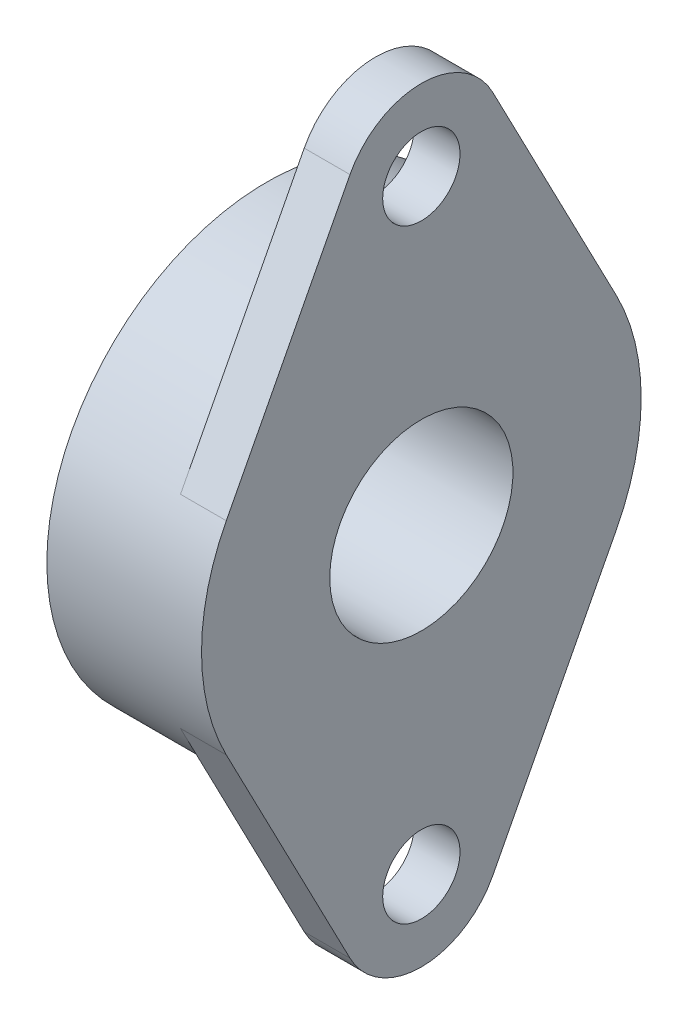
ISO-10303-21;
HEADER;
FILE_DESCRIPTION(('STEP AP214'),'2;1');
FILE_NAME('part.step','',(''),(''),'','','');
FILE_SCHEMA(('AUTOMOTIVE_DESIGN { 1 0 10303 214 1 1 1 1 }'));
ENDSEC;
DATA;
#1=APPLICATION_CONTEXT('core data for automotive mechanical design processes');
#2=APPLICATION_PROTOCOL_DEFINITION('international standard','automotive_design',2000,#1);
#3=PRODUCT_CONTEXT('',#1,'mechanical');
#4=PRODUCT('Part','Part','',(#3));
#5=PRODUCT_RELATED_PRODUCT_CATEGORY('part','',(#4));
#6=PRODUCT_DEFINITION_FORMATION('','',#4);
#7=PRODUCT_DEFINITION_CONTEXT('part definition',#1,'design');
#8=PRODUCT_DEFINITION('design','',#6,#7);
#9=PRODUCT_DEFINITION_SHAPE('','',#8);
#10=(LENGTH_UNIT() NAMED_UNIT(*) SI_UNIT(.MILLI.,.METRE.));
#11=(NAMED_UNIT(*) PLANE_ANGLE_UNIT() SI_UNIT($,.RADIAN.));
#12=(NAMED_UNIT(*) SI_UNIT($,.STERADIAN.) SOLID_ANGLE_UNIT());
#13=UNCERTAINTY_MEASURE_WITH_UNIT(LENGTH_MEASURE(1.E-05),#10,'distance_accuracy_value','');
#14=(GEOMETRIC_REPRESENTATION_CONTEXT(3) GLOBAL_UNCERTAINTY_ASSIGNED_CONTEXT((#13)) GLOBAL_UNIT_ASSIGNED_CONTEXT((#10,
#11,#12)) REPRESENTATION_CONTEXT('',''));
#15=CARTESIAN_POINT('',(0.,0.,0.));
#16=DIRECTION('',(0.,0.,1.));
#17=DIRECTION('',(1.,0.,0.));
#18=AXIS2_PLACEMENT_3D('',#15,#16,#17);
#19=CARTESIAN_POINT('',(-11.25,24.49885657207,-47.9117646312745));
#20=DIRECTION('',(-1.,0.,0.));
#21=DIRECTION('',(0.,0.,1.));
#22=AXIS2_PLACEMENT_3D('',#19,#20,#21);
#23=PLANE('',#22);
#24=CARTESIAN_POINT('',(-11.25,74.25,0.));
#25=DIRECTION('',(-1.,0.,0.));
#26=DIRECTION('',(0.,0.,1.));
#27=AXIS2_PLACEMENT_3D('',#24,#25,#26);
#28=CIRCLE('',#27,9.50000000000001);
#29=CARTESIAN_POINT('',(-11.25,74.25,9.50000000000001));
#30=VERTEX_POINT('',#29);
#31=EDGE_CURVE('E193',#30,#30,#28,.T.);
#32=ORIENTED_EDGE('',*,*,#31,.F.);
#33=EDGE_LOOP('',(#32));
#34=FACE_BOUND('',#33,.T.);
#35=DIRECTION('',(0.,0.887254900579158,0.46127946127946));
#36=VECTOR('',#35,1.);
#37=CARTESIAN_POINT('',(-11.25,54.1346801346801,-32.7175244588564));
#38=LINE('',#37,#36);
#39=CARTESIAN_POINT('',(-11.25,24.9133763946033,-47.9095365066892));
#40=VERTEX_POINT('',#39);
#41=CARTESIAN_POINT('',(-11.25,83.3602693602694,-17.5232842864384));
#42=VERTEX_POINT('',#41);
#43=EDGE_CURVE('E95',#40,#42,#38,.T.);
#44=ORIENTED_EDGE('',*,*,#43,.F.);
#45=CARTESIAN_POINT('',(-11.25,0.,0.));
#46=DIRECTION('',(-1.,0.,0.));
#47=DIRECTION('',(0.,0.,1.));
#48=AXIS2_PLACEMENT_3D('',#45,#46,#47);
#49=CIRCLE('',#48,54.);
#50=CARTESIAN_POINT('',(-11.25,24.9133765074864,47.9095364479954));
#51=VERTEX_POINT('',#50);
#52=EDGE_CURVE('E105',#51,#40,#49,.T.);
#53=ORIENTED_EDGE('',*,*,#52,.F.);
#54=DIRECTION('',(0.,-0.887254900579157,0.461279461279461));
#55=VECTOR('',#54,1.);
#56=CARTESIAN_POINT('',(-11.25,54.1346801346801,32.7175244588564));
#57=LINE('',#56,#55);
#58=CARTESIAN_POINT('',(-11.25,83.3602693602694,17.5232842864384));
#59=VERTEX_POINT('',#58);
#60=EDGE_CURVE('E101',#59,#51,#57,.T.);
#61=ORIENTED_EDGE('',*,*,#60,.F.);
#62=CARTESIAN_POINT('',(-11.25,74.25,0.));
#63=DIRECTION('',(1.,0.,0.));
#64=DIRECTION('',(0.,0.,-1.));
#65=AXIS2_PLACEMENT_3D('',#62,#63,#64);
#66=CIRCLE('',#65,19.75);
#67=EDGE_CURVE('E103',#42,#59,#66,.T.);
#68=ORIENTED_EDGE('',*,*,#67,.F.);
#69=EDGE_LOOP('',(#44,#53,#61,#68));
#70=FACE_BOUND('',#69,.T.);
#71=ADVANCED_FACE('F16',(#34,#70),#23,.T.);
#72=CARTESIAN_POINT('',(-11.25,-94.4145305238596,-47.9117646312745));
#73=DIRECTION('',(-1.,0.,0.));
#74=DIRECTION('',(0.,0.,1.));
#75=AXIS2_PLACEMENT_3D('',#72,#73,#74);
#76=PLANE('',#75);
#77=CARTESIAN_POINT('',(-11.25,-74.25,0.));
#78=DIRECTION('',(-1.,0.,0.));
#79=DIRECTION('',(0.,0.,1.));
#80=AXIS2_PLACEMENT_3D('',#77,#78,#79);
#81=CIRCLE('',#80,9.49999999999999);
#82=CARTESIAN_POINT('',(-11.25,-74.25,9.49999999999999));
#83=VERTEX_POINT('',#82);
#84=EDGE_CURVE('E190',#83,#83,#81,.T.);
#85=ORIENTED_EDGE('',*,*,#84,.F.);
#86=EDGE_LOOP('',(#85));
#87=FACE_BOUND('',#86,.T.);
#88=DIRECTION('',(0.,0.887254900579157,-0.461279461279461));
#89=VECTOR('',#88,1.);
#90=CARTESIAN_POINT('',(-11.25,-54.1346801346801,-32.7175244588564));
#91=LINE('',#90,#89);
#92=CARTESIAN_POINT('',(-11.25,-83.3602693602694,-17.5232842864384));
#93=VERTEX_POINT('',#92);
#94=CARTESIAN_POINT('',(-11.25,-24.9121374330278,-47.9101806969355));
#95=VERTEX_POINT('',#94);
#96=EDGE_CURVE('E158',#93,#95,#91,.T.);
#97=ORIENTED_EDGE('',*,*,#96,.F.);
#98=CARTESIAN_POINT('',(-11.25,-74.25,0.));
#99=DIRECTION('',(1.,0.,0.));
#100=DIRECTION('',(0.,0.,-1.));
#101=AXIS2_PLACEMENT_3D('',#98,#99,#100);
#102=CIRCLE('',#101,19.75);
#103=CARTESIAN_POINT('',(-11.25,-83.3602693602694,17.5232842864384));
#104=VERTEX_POINT('',#103);
#105=EDGE_CURVE('E19',#104,#93,#102,.T.);
#106=ORIENTED_EDGE('',*,*,#105,.F.);
#107=DIRECTION('',(0.,-0.887254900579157,-0.461279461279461));
#108=VECTOR('',#107,1.);
#109=CARTESIAN_POINT('',(-11.25,-54.1346801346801,32.7175244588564));
#110=LINE('',#109,#108);
#111=CARTESIAN_POINT('',(-11.25,-24.9133763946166,47.9095365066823));
#112=VERTEX_POINT('',#111);
#113=EDGE_CURVE('E149',#112,#104,#110,.T.);
#114=ORIENTED_EDGE('',*,*,#113,.F.);
#115=CARTESIAN_POINT('',(-11.25,0.,0.));
#116=DIRECTION('',(-1.,0.,0.));
#117=DIRECTION('',(0.,0.,1.));
#118=AXIS2_PLACEMENT_3D('',#115,#116,#117);
#119=CIRCLE('',#118,54.);
#120=EDGE_CURVE('E34',#95,#112,#119,.T.);
#121=ORIENTED_EDGE('',*,*,#120,.F.);
#122=EDGE_LOOP('',(#97,#106,#114,#121));
#123=FACE_BOUND('',#122,.T.);
#124=ADVANCED_FACE('F204',(#87,#123),#76,.T.);
#125=CARTESIAN_POINT('',(-38.,-54.,54.6480021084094));
#126=DIRECTION('',(-1.,0.,0.));
#127=DIRECTION('',(0.,1.,0.));
#128=AXIS2_PLACEMENT_3D('',#125,#126,#127);
#129=PLANE('',#128);
#130=CARTESIAN_POINT('',(-38.,0.,0.));
#131=DIRECTION('',(-1.,0.,0.));
#132=DIRECTION('',(0.,0.,1.));
#133=AXIS2_PLACEMENT_3D('',#130,#131,#132);
#134=CIRCLE('',#133,33.75);
#135=CARTESIAN_POINT('',(-38.,0.,33.75));
#136=VERTEX_POINT('',#135);
#137=EDGE_CURVE('E187',#136,#136,#134,.T.);
#138=ORIENTED_EDGE('',*,*,#137,.F.);
#139=EDGE_LOOP('',(#138));
#140=FACE_BOUND('',#139,.T.);
#141=CARTESIAN_POINT('',(-38.,0.,0.));
#142=DIRECTION('',(-1.,0.,0.));
#143=DIRECTION('',(0.,0.,1.));
#144=AXIS2_PLACEMENT_3D('',#141,#142,#143);
#145=CIRCLE('',#144,54.);
#146=CARTESIAN_POINT('',(-38.,0.,54.));
#147=VERTEX_POINT('',#146);
#148=EDGE_CURVE('E121',#147,#147,#145,.F.);
#149=ORIENTED_EDGE('',*,*,#148,.F.);
#150=EDGE_LOOP('',(#149));
#151=FACE_BOUND('',#150,.T.);
#152=ADVANCED_FACE('F287',(#140,#151),#129,.T.);
#153=CARTESIAN_POINT('',(0.,-74.25,0.));
#154=DIRECTION('',(1.,0.,0.));
#155=DIRECTION('',(0.,0.,-1.));
#156=AXIS2_PLACEMENT_3D('',#153,#154,#155);
#157=CYLINDRICAL_SURFACE('',#156,19.75);
#158=CARTESIAN_POINT('',(0.,-74.25,0.));
#159=DIRECTION('',(1.,0.,0.));
#160=DIRECTION('',(0.,0.,-1.));
#161=AXIS2_PLACEMENT_3D('',#158,#159,#160);
#162=CIRCLE('',#161,19.75);
#163=CARTESIAN_POINT('',(0.,-83.3602693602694,17.5232842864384));
#164=VERTEX_POINT('',#163);
#165=CARTESIAN_POINT('',(0.,-83.3602693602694,-17.5232842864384));
#166=VERTEX_POINT('',#165);
#167=EDGE_CURVE('E184',#164,#166,#162,.T.);
#168=ORIENTED_EDGE('',*,*,#167,.F.);
#169=DIRECTION('',(1.,0.,0.));
#170=VECTOR('',#169,1.);
#171=CARTESIAN_POINT('',(-11.25,-83.3602693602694,17.5232842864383));
#172=LINE('',#171,#170);
#173=EDGE_CURVE('E150',#104,#164,#172,.T.);
#174=ORIENTED_EDGE('',*,*,#173,.F.);
#175=ORIENTED_EDGE('',*,*,#105,.T.);
#176=DIRECTION('',(1.,0.,0.));
#177=VECTOR('',#176,1.);
#178=CARTESIAN_POINT('',(-11.25,-83.3602693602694,-17.5232842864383));
#179=LINE('',#178,#177);
#180=EDGE_CURVE('E141',#166,#93,#179,.F.);
#181=ORIENTED_EDGE('',*,*,#180,.F.);
#182=EDGE_LOOP('',(#168,#174,#175,#181));
#183=FACE_BOUND('',#182,.T.);
#184=ADVANCED_FACE('F207',(#183),#157,.T.);
#185=CARTESIAN_POINT('',(-11.25,-83.3602693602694,-17.5232842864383));
#186=DIRECTION('',(0.,-0.461279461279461,-0.887254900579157));
#187=DIRECTION('',(0.,0.887254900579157,-0.461279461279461));
#188=AXIS2_PLACEMENT_3D('',#185,#186,#187);
#189=PLANE('',#188);
#190=CARTESIAN_POINT('',(0.,-83.3602693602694,-17.5232842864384));
#191=CARTESIAN_POINT('',(0.,-80.9248035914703,-18.7894709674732));
#192=CARTESIAN_POINT('',(0.,-78.4893378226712,-20.055657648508));
#193=CARTESIAN_POINT('',(0.,-73.618406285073,-22.5880310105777));
#194=CARTESIAN_POINT('',(0.,-71.1829405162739,-23.8542176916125));
#195=CARTESIAN_POINT('',(0.,-66.3120089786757,-26.3865910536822));
#196=CARTESIAN_POINT('',(0.,-63.8765432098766,-27.6527777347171));
#197=CARTESIAN_POINT('',(0.,-59.0056116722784,-30.1851510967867));
#198=CARTESIAN_POINT('',(0.,-56.5701459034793,-31.4513377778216));
#199=CARTESIAN_POINT('',(0.,-51.699214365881,-33.9837111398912));
#200=CARTESIAN_POINT('',(0.,-49.2637485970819,-35.2498978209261));
#201=CARTESIAN_POINT('',(0.,-44.3928170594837,-37.7822711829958));
#202=CARTESIAN_POINT('',(0.,-41.9573512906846,-39.0484578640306));
#203=CARTESIAN_POINT('',(0.,-37.0864197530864,-41.5808312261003));
#204=CARTESIAN_POINT('',(0.,-34.6509539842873,-42.8470179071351));
#205=CARTESIAN_POINT('',(0.,-29.7800224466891,-45.3793912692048));
#206=CARTESIAN_POINT('',(0.,-27.34455667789,-46.6455779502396));
#207=CARTESIAN_POINT('',(0.,-24.9090909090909,-47.9117646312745));
#208=B_SPLINE_CURVE_WITH_KNOTS('',3,(#190,#191,#192,#193,#194,#195,#196,#197,#198,#199,#200,
#201,#202,#203,#204,#205,#206,#207),.UNSPECIFIED.,.F.,.F.,(4,2,2,2,2,2,2,2,4),(0.,
8.23483454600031,16.4696690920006,24.7045036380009,32.9393381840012,41.1741727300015,
49.4090072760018,57.6438418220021,65.8786763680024),.UNSPECIFIED.);
#209=CARTESIAN_POINT('',(0.,-24.9090909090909,-47.9117646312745));
#210=VERTEX_POINT('',#209);
#211=EDGE_CURVE('E183',#166,#210,#208,.T.);
#212=ORIENTED_EDGE('',*,*,#211,.F.);
#213=ORIENTED_EDGE('',*,*,#180,.T.);
#214=ORIENTED_EDGE('',*,*,#96,.T.);
#215=CARTESIAN_POINT('',(-11.25,-24.9090909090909,-47.9117646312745));
#216=VERTEX_POINT('',#215);
#217=EDGE_CURVE('E144',#95,#216,#91,.T.);
#218=ORIENTED_EDGE('',*,*,#217,.T.);
#219=DIRECTION('',(-1.,0.,0.));
#220=VECTOR('',#219,1.);
#221=CARTESIAN_POINT('',(-19.,-24.9090909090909,-47.9117646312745));
#222=LINE('',#221,#220);
#223=EDGE_CURVE('E135',#210,#216,#222,.T.);
#224=ORIENTED_EDGE('',*,*,#223,.F.);
#225=EDGE_LOOP('',(#212,#213,#214,#218,#224));
#226=FACE_BOUND('',#225,.T.);
#227=ADVANCED_FACE('F203',(#226),#189,.T.);
#228=CARTESIAN_POINT('',(-11.25,24.9090909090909,-47.9117646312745));
#229=DIRECTION('',(0.,0.461279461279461,-0.887254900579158));
#230=DIRECTION('',(0.,0.887254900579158,0.461279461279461));
#231=AXIS2_PLACEMENT_3D('',#228,#229,#230);
#232=PLANE('',#231);
#233=CARTESIAN_POINT('',(0.,24.9090909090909,-47.9117646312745));
#234=CARTESIAN_POINT('',(0.,27.34455667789,-46.6455779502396));
#235=CARTESIAN_POINT('',(0.,29.7800224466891,-45.3793912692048));
#236=CARTESIAN_POINT('',(0.,34.6509539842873,-42.8470179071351));
#237=CARTESIAN_POINT('',(0.,37.0864197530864,-41.5808312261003));
#238=CARTESIAN_POINT('',(0.,41.9573512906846,-39.0484578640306));
#239=CARTESIAN_POINT('',(0.,44.3928170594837,-37.7822711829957));
#240=CARTESIAN_POINT('',(0.,49.2637485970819,-35.2498978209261));
#241=CARTESIAN_POINT('',(0.,51.699214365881,-33.9837111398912));
#242=CARTESIAN_POINT('',(0.,56.5701459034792,-31.4513377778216));
#243=CARTESIAN_POINT('',(0.,59.0056116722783,-30.1851510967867));
#244=CARTESIAN_POINT('',(0.,63.8765432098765,-27.652777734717));
#245=CARTESIAN_POINT('',(0.,66.3120089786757,-26.3865910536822));
#246=CARTESIAN_POINT('',(0.,71.1829405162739,-23.8542176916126));
#247=CARTESIAN_POINT('',(0.,73.618406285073,-22.5880310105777));
#248=CARTESIAN_POINT('',(0.,78.4893378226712,-20.055657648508));
#249=CARTESIAN_POINT('',(0.,80.9248035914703,-18.7894709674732));
#250=CARTESIAN_POINT('',(0.,83.3602693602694,-17.5232842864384));
#251=B_SPLINE_CURVE_WITH_KNOTS('',3,(#233,#234,#235,#236,#237,#238,#239,#240,#241,#242,#243,
#244,#245,#246,#247,#248,#249,#250),.UNSPECIFIED.,.F.,.F.,(4,2,2,2,2,2,2,2,4),(0.,
8.23483454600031,16.4696690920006,24.7045036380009,32.9393381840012,41.1741727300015,
49.4090072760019,57.6438418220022,65.8786763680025),.UNSPECIFIED.);
#252=CARTESIAN_POINT('',(0.,24.9090909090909,-47.9117646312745));
#253=VERTEX_POINT('',#252);
#254=CARTESIAN_POINT('',(0.,83.3602693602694,-17.5232842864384));
#255=VERTEX_POINT('',#254);
#256=EDGE_CURVE('E179',#253,#255,#251,.T.);
#257=ORIENTED_EDGE('',*,*,#256,.F.);
#258=DIRECTION('',(1.,0.,0.));
#259=VECTOR('',#258,1.);
#260=CARTESIAN_POINT('',(-11.25,24.9090909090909,-47.9117646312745));
#261=LINE('',#260,#259);
#262=CARTESIAN_POINT('',(-11.25,24.9090909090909,-47.9117646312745));
#263=VERTEX_POINT('',#262);
#264=EDGE_CURVE('E116',#253,#263,#261,.F.);
#265=ORIENTED_EDGE('',*,*,#264,.T.);
#266=CARTESIAN_POINT('',(-11.25,0.,0.));
#267=DIRECTION('',(-1.,0.,0.));
#268=DIRECTION('',(0.,1.,0.));
#269=AXIS2_PLACEMENT_3D('',#266,#267,#268);
#270=CIRCLE('',#269,54.);
#271=EDGE_CURVE('E138',#40,#263,#270,.T.);
#272=ORIENTED_EDGE('',*,*,#271,.F.);
#273=ORIENTED_EDGE('',*,*,#43,.T.);
#274=DIRECTION('',(-1.,0.,0.));
#275=VECTOR('',#274,1.);
#276=CARTESIAN_POINT('',(-5.625,83.3602693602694,-17.5232842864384));
#277=LINE('',#276,#275);
#278=EDGE_CURVE('E109',#255,#42,#277,.T.);
#279=ORIENTED_EDGE('',*,*,#278,.F.);
#280=EDGE_LOOP('',(#257,#265,#272,#273,#279));
#281=FACE_BOUND('',#280,.T.);
#282=ADVANCED_FACE('F259',(#281),#232,.T.);
#283=CARTESIAN_POINT('',(0.,74.25,0.));
#284=DIRECTION('',(1.,0.,0.));
#285=DIRECTION('',(0.,0.,-1.));
#286=AXIS2_PLACEMENT_3D('',#283,#284,#285);
#287=CYLINDRICAL_SURFACE('',#286,19.75);
#288=CARTESIAN_POINT('',(0.,74.25,0.));
#289=DIRECTION('',(1.,0.,0.));
#290=DIRECTION('',(0.,0.,-1.));
#291=AXIS2_PLACEMENT_3D('',#288,#289,#290);
#292=CIRCLE('',#291,19.75);
#293=CARTESIAN_POINT('',(0.,83.3602693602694,17.5232842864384));
#294=VERTEX_POINT('',#293);
#295=EDGE_CURVE('E177',#255,#294,#292,.T.);
#296=ORIENTED_EDGE('',*,*,#295,.F.);
#297=ORIENTED_EDGE('',*,*,#278,.T.);
#298=ORIENTED_EDGE('',*,*,#67,.T.);
#299=DIRECTION('',(1.,0.,0.));
#300=VECTOR('',#299,1.);
#301=CARTESIAN_POINT('',(-11.25,83.3602693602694,17.5232842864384));
#302=LINE('',#301,#300);
#303=EDGE_CURVE('E114',#294,#59,#302,.F.);
#304=ORIENTED_EDGE('',*,*,#303,.F.);
#305=EDGE_LOOP('',(#296,#297,#298,#304));
#306=FACE_BOUND('',#305,.T.);
#307=ADVANCED_FACE('F113',(#306),#287,.T.);
#308=CARTESIAN_POINT('',(-11.25,83.3602693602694,17.5232842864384));
#309=DIRECTION('',(0.,0.461279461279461,0.887254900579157));
#310=DIRECTION('',(0.,-0.887254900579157,0.461279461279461));
#311=AXIS2_PLACEMENT_3D('',#308,#309,#310);
#312=PLANE('',#311);
#313=CARTESIAN_POINT('',(0.,83.3602693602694,17.5232842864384));
#314=CARTESIAN_POINT('',(0.,80.9248035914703,18.7894709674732));
#315=CARTESIAN_POINT('',(0.,78.4893378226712,20.055657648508));
#316=CARTESIAN_POINT('',(0.,73.618406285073,22.5880310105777));
#317=CARTESIAN_POINT('',(0.,71.1829405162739,23.8542176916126));
#318=CARTESIAN_POINT('',(0.,66.3120089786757,26.3865910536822));
#319=CARTESIAN_POINT('',(0.,63.8765432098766,27.6527777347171));
#320=CARTESIAN_POINT('',(0.,59.0056116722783,30.1851510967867));
#321=CARTESIAN_POINT('',(0.,56.5701459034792,31.4513377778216));
#322=CARTESIAN_POINT('',(0.,51.699214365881,33.9837111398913));
#323=CARTESIAN_POINT('',(0.,49.2637485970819,35.2498978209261));
#324=CARTESIAN_POINT('',(0.,44.3928170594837,37.7822711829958));
#325=CARTESIAN_POINT('',(0.,41.9573512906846,39.0484578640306));
#326=CARTESIAN_POINT('',(0.,37.0864197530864,41.5808312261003));
#327=CARTESIAN_POINT('',(0.,34.6509539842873,42.8470179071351));
#328=CARTESIAN_POINT('',(0.,29.7800224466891,45.3793912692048));
#329=CARTESIAN_POINT('',(0.,27.34455667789,46.6455779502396));
#330=CARTESIAN_POINT('',(0.,24.9090909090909,47.9117646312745));
#331=B_SPLINE_CURVE_WITH_KNOTS('',3,(#313,#314,#315,#316,#317,#318,#319,#320,#321,#322,#323,
#324,#325,#326,#327,#328,#329,#330),.UNSPECIFIED.,.F.,.F.,(4,2,2,2,2,2,2,2,4),(0.,
8.23483454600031,16.4696690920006,24.7045036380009,32.9393381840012,41.1741727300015,
49.4090072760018,57.6438418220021,65.8786763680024),.UNSPECIFIED.);
#332=CARTESIAN_POINT('',(0.,24.9090909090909,47.9117646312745));
#333=VERTEX_POINT('',#332);
#334=EDGE_CURVE('E119',#294,#333,#331,.T.);
#335=ORIENTED_EDGE('',*,*,#334,.F.);
#336=ORIENTED_EDGE('',*,*,#303,.T.);
#337=ORIENTED_EDGE('',*,*,#60,.T.);
#338=CARTESIAN_POINT('',(-11.25,24.9090909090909,47.9117646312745));
#339=VERTEX_POINT('',#338);
#340=EDGE_CURVE('E108',#51,#339,#57,.T.);
#341=ORIENTED_EDGE('',*,*,#340,.T.);
#342=DIRECTION('',(-1.,0.,0.));
#343=VECTOR('',#342,1.);
#344=CARTESIAN_POINT('',(-19.,24.9090909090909,47.9117646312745));
#345=LINE('',#344,#343);
#346=EDGE_CURVE('E146',#333,#339,#345,.T.);
#347=ORIENTED_EDGE('',*,*,#346,.F.);
#348=EDGE_LOOP('',(#335,#336,#337,#341,#347));
#349=FACE_BOUND('',#348,.T.);
#350=ADVANCED_FACE('F117',(#349),#312,.T.);
#351=CARTESIAN_POINT('',(-38.,0.,0.));
#352=DIRECTION('',(-1.,0.,0.));
#353=DIRECTION('',(0.,0.,1.));
#354=AXIS2_PLACEMENT_3D('',#351,#352,#353);
#355=CYLINDRICAL_SURFACE('',#354,54.);
#356=ORIENTED_EDGE('',*,*,#148,.T.);
#357=EDGE_LOOP('',(#356));
#358=FACE_BOUND('',#357,.T.);
#359=ORIENTED_EDGE('',*,*,#346,.T.);
#360=ORIENTED_EDGE('',*,*,#340,.F.);
#361=ORIENTED_EDGE('',*,*,#52,.T.);
#362=ORIENTED_EDGE('',*,*,#271,.T.);
#363=ORIENTED_EDGE('',*,*,#264,.F.);
#364=CARTESIAN_POINT('',(0.,0.,0.));
#365=DIRECTION('',(-1.,0.,0.));
#366=DIRECTION('',(0.,0.,1.));
#367=AXIS2_PLACEMENT_3D('',#364,#365,#366);
#368=CIRCLE('',#367,54.);
#369=EDGE_CURVE('E180',#210,#253,#368,.F.);
#370=ORIENTED_EDGE('',*,*,#369,.F.);
#371=ORIENTED_EDGE('',*,*,#223,.T.);
#372=ORIENTED_EDGE('',*,*,#217,.F.);
#373=ORIENTED_EDGE('',*,*,#120,.T.);
#374=CARTESIAN_POINT('',(-11.25,0.,0.));
#375=DIRECTION('',(-1.,0.,0.));
#376=DIRECTION('',(0.,1.,0.));
#377=AXIS2_PLACEMENT_3D('',#374,#375,#376);
#378=CIRCLE('',#377,54.);
#379=CARTESIAN_POINT('',(-11.25,-24.9090909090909,47.9117646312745));
#380=VERTEX_POINT('',#379);
#381=EDGE_CURVE('E57',#112,#380,#378,.T.);
#382=ORIENTED_EDGE('',*,*,#381,.T.);
#383=DIRECTION('',(1.,0.,0.));
#384=VECTOR('',#383,1.);
#385=CARTESIAN_POINT('',(-11.25,-24.9090909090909,47.9117646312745));
#386=LINE('',#385,#384);
#387=CARTESIAN_POINT('',(0.,-24.9090909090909,47.9117646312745));
#388=VERTEX_POINT('',#387);
#389=EDGE_CURVE('E196',#388,#380,#386,.F.);
#390=ORIENTED_EDGE('',*,*,#389,.F.);
#391=CARTESIAN_POINT('',(0.,0.,0.));
#392=DIRECTION('',(-1.,0.,0.));
#393=DIRECTION('',(0.,0.,1.));
#394=AXIS2_PLACEMENT_3D('',#391,#392,#393);
#395=CIRCLE('',#394,54.);
#396=EDGE_CURVE('E174',#333,#388,#395,.F.);
#397=ORIENTED_EDGE('',*,*,#396,.F.);
#398=EDGE_LOOP('',(#359,#360,#361,#362,#363,#370,#371,#372,#373,#382,#390,#397));
#399=FACE_BOUND('',#398,.T.);
#400=ADVANCED_FACE('F199',(#358,#399),#355,.T.);
#401=CARTESIAN_POINT('',(-11.25,-24.9090909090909,47.9117646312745));
#402=DIRECTION('',(0.,-0.461279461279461,0.887254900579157));
#403=DIRECTION('',(0.,-0.887254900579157,-0.461279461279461));
#404=AXIS2_PLACEMENT_3D('',#401,#402,#403);
#405=PLANE('',#404);
#406=CARTESIAN_POINT('',(0.,-24.9090909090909,47.9117646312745));
#407=CARTESIAN_POINT('',(0.,-27.34455667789,46.6455779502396));
#408=CARTESIAN_POINT('',(0.,-29.7800224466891,45.3793912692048));
#409=CARTESIAN_POINT('',(0.,-34.6509539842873,42.8470179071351));
#410=CARTESIAN_POINT('',(0.,-37.0864197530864,41.5808312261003));
#411=CARTESIAN_POINT('',(0.,-41.9573512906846,39.0484578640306));
#412=CARTESIAN_POINT('',(0.,-44.3928170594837,37.7822711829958));
#413=CARTESIAN_POINT('',(0.,-49.2637485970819,35.2498978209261));
#414=CARTESIAN_POINT('',(0.,-51.699214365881,33.9837111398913));
#415=CARTESIAN_POINT('',(0.,-56.5701459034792,31.4513377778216));
#416=CARTESIAN_POINT('',(0.,-59.0056116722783,30.1851510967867));
#417=CARTESIAN_POINT('',(0.,-63.8765432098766,27.6527777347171));
#418=CARTESIAN_POINT('',(0.,-66.3120089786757,26.3865910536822));
#419=CARTESIAN_POINT('',(0.,-71.1829405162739,23.8542176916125));
#420=CARTESIAN_POINT('',(0.,-73.618406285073,22.5880310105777));
#421=CARTESIAN_POINT('',(0.,-78.4893378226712,20.055657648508));
#422=CARTESIAN_POINT('',(0.,-80.9248035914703,18.7894709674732));
#423=CARTESIAN_POINT('',(0.,-83.3602693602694,17.5232842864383));
#424=B_SPLINE_CURVE_WITH_KNOTS('',3,(#406,#407,#408,#409,#410,#411,#412,#413,#414,#415,#416,
#417,#418,#419,#420,#421,#422,#423),.UNSPECIFIED.,.F.,.F.,(4,2,2,2,2,2,2,2,4),(0.,
8.23483454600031,16.4696690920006,24.7045036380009,32.9393381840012,41.1741727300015,
49.4090072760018,57.6438418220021,65.8786763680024),.UNSPECIFIED.);
#425=EDGE_CURVE('E173',#388,#164,#424,.T.);
#426=ORIENTED_EDGE('',*,*,#425,.F.);
#427=ORIENTED_EDGE('',*,*,#389,.T.);
#428=ORIENTED_EDGE('',*,*,#381,.F.);
#429=ORIENTED_EDGE('',*,*,#113,.T.);
#430=ORIENTED_EDGE('',*,*,#173,.T.);
#431=EDGE_LOOP('',(#426,#427,#428,#429,#430));
#432=FACE_BOUND('',#431,.T.);
#433=ADVANCED_FACE('F294',(#432),#405,.T.);
#434=CARTESIAN_POINT('',(0.,74.25,0.));
#435=DIRECTION('',(-1.,0.,0.));
#436=DIRECTION('',(0.,0.,1.));
#437=AXIS2_PLACEMENT_3D('',#434,#435,#436);
#438=CYLINDRICAL_SURFACE('',#437,9.50000000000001);
#439=CARTESIAN_POINT('',(0.,74.25,0.));
#440=DIRECTION('',(-1.,0.,0.));
#441=DIRECTION('',(0.,0.,1.));
#442=AXIS2_PLACEMENT_3D('',#439,#440,#441);
#443=CIRCLE('',#442,9.50000000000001);
#444=CARTESIAN_POINT('',(0.,74.25,9.50000000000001));
#445=VERTEX_POINT('',#444);
#446=EDGE_CURVE('E170',#445,#445,#443,.T.);
#447=ORIENTED_EDGE('',*,*,#446,.F.);
#448=EDGE_LOOP('',(#447));
#449=FACE_BOUND('',#448,.T.);
#450=ORIENTED_EDGE('',*,*,#31,.T.);
#451=EDGE_LOOP('',(#450));
#452=FACE_BOUND('',#451,.T.);
#453=ADVANCED_FACE('F300',(#449,#452),#438,.F.);
#454=CARTESIAN_POINT('',(0.,-74.25,0.));
#455=DIRECTION('',(-1.,0.,0.));
#456=DIRECTION('',(0.,0.,1.));
#457=AXIS2_PLACEMENT_3D('',#454,#455,#456);
#458=CYLINDRICAL_SURFACE('',#457,9.49999999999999);
#459=CARTESIAN_POINT('',(0.,-74.25,0.));
#460=DIRECTION('',(-1.,0.,0.));
#461=DIRECTION('',(0.,0.,1.));
#462=AXIS2_PLACEMENT_3D('',#459,#460,#461);
#463=CIRCLE('',#462,9.49999999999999);
#464=CARTESIAN_POINT('',(0.,-74.25,9.49999999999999));
#465=VERTEX_POINT('',#464);
#466=EDGE_CURVE('E167',#465,#465,#463,.T.);
#467=ORIENTED_EDGE('',*,*,#466,.F.);
#468=EDGE_LOOP('',(#467));
#469=FACE_BOUND('',#468,.T.);
#470=ORIENTED_EDGE('',*,*,#84,.T.);
#471=EDGE_LOOP('',(#470));
#472=FACE_BOUND('',#471,.T.);
#473=ADVANCED_FACE('F284',(#469,#472),#458,.F.);
#474=CARTESIAN_POINT('',(-52.2,0.,0.));
#475=DIRECTION('',(-1.,0.,0.));
#476=DIRECTION('',(0.,0.,1.));
#477=AXIS2_PLACEMENT_3D('',#474,#475,#476);
#478=CYLINDRICAL_SURFACE('',#477,33.75);
#479=CARTESIAN_POINT('',(-52.2,0.,0.));
#480=DIRECTION('',(-1.,0.,0.));
#481=DIRECTION('',(0.,0.,1.));
#482=AXIS2_PLACEMENT_3D('',#479,#480,#481);
#483=CIRCLE('',#482,33.75);
#484=CARTESIAN_POINT('',(-52.2,0.,33.75));
#485=VERTEX_POINT('',#484);
#486=EDGE_CURVE('E164',#485,#485,#483,.T.);
#487=ORIENTED_EDGE('',*,*,#486,.F.);
#488=EDGE_LOOP('',(#487));
#489=FACE_BOUND('',#488,.T.);
#490=ORIENTED_EDGE('',*,*,#137,.T.);
#491=EDGE_LOOP('',(#490));
#492=FACE_BOUND('',#491,.T.);
#493=ADVANCED_FACE('F239',(#489,#492),#478,.T.);
#494=CARTESIAN_POINT('',(0.,95.8988,54.));
#495=CARTESIAN_POINT('',(0.,94.,54.));
#496=CARTESIAN_POINT('',(0.,-94.,54.));
#497=CARTESIAN_POINT('',(0.,-95.88,54.));
#498=B_SPLINE_CURVE_WITH_KNOTS('',1,(#494,#495,#496,#497),.UNSPECIFIED.,.F.,.F.,(2,1,1,2),
(-0.0101,0.,1.,1.01),.UNSPECIFIED.);
#499=DIRECTION('',(0.,0.,-1.));
#500=VECTOR('',#499,1.);
#501=SURFACE_OF_LINEAR_EXTRUSION('',#498,#500);
#502=CARTESIAN_POINT('',(0.,0.,0.));
#503=DIRECTION('',(-1.,0.,0.));
#504=DIRECTION('',(0.,0.,1.));
#505=AXIS2_PLACEMENT_3D('',#502,#503,#504);
#506=CIRCLE('',#505,22.5);
#507=CARTESIAN_POINT('',(0.,0.,22.5));
#508=VERTEX_POINT('',#507);
#509=EDGE_CURVE('E25',#508,#508,#506,.F.);
#510=ORIENTED_EDGE('',*,*,#509,.F.);
#511=EDGE_LOOP('',(#510));
#512=FACE_BOUND('',#511,.T.);
#513=ORIENTED_EDGE('',*,*,#466,.T.);
#514=EDGE_LOOP('',(#513));
#515=FACE_BOUND('',#514,.T.);
#516=ORIENTED_EDGE('',*,*,#446,.T.);
#517=EDGE_LOOP('',(#516));
#518=FACE_BOUND('',#517,.T.);
#519=ORIENTED_EDGE('',*,*,#396,.T.);
#520=ORIENTED_EDGE('',*,*,#425,.T.);
#521=ORIENTED_EDGE('',*,*,#167,.T.);
#522=ORIENTED_EDGE('',*,*,#211,.T.);
#523=ORIENTED_EDGE('',*,*,#369,.T.);
#524=ORIENTED_EDGE('',*,*,#256,.T.);
#525=ORIENTED_EDGE('',*,*,#295,.T.);
#526=ORIENTED_EDGE('',*,*,#334,.T.);
#527=EDGE_LOOP('',(#519,#520,#521,#522,#523,#524,#525,#526));
#528=FACE_BOUND('',#527,.T.);
#529=ADVANCED_FACE('F218',(#512,#515,#518,#528),#501,.T.);
#530=CARTESIAN_POINT('',(-52.2,-33.75,34.1550021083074));
#531=DIRECTION('',(-1.,0.,0.));
#532=DIRECTION('',(0.,1.,0.));
#533=AXIS2_PLACEMENT_3D('',#530,#531,#532);
#534=PLANE('',#533);
#535=CARTESIAN_POINT('',(-52.2,0.,0.));
#536=DIRECTION('',(-1.,0.,0.));
#537=DIRECTION('',(0.,0.,1.));
#538=AXIS2_PLACEMENT_3D('',#535,#536,#537);
#539=CIRCLE('',#538,22.5);
#540=CARTESIAN_POINT('',(-52.2,0.,22.5));
#541=VERTEX_POINT('',#540);
#542=EDGE_CURVE('E10',#541,#541,#539,.T.);
#543=ORIENTED_EDGE('',*,*,#542,.F.);
#544=EDGE_LOOP('',(#543));
#545=FACE_BOUND('',#544,.T.);
#546=ORIENTED_EDGE('',*,*,#486,.T.);
#547=EDGE_LOOP('',(#546));
#548=FACE_BOUND('',#547,.T.);
#549=ADVANCED_FACE('F238',(#545,#548),#534,.T.);
#550=CARTESIAN_POINT('',(0.,0.,0.));
#551=DIRECTION('',(-1.,0.,0.));
#552=DIRECTION('',(0.,0.,1.));
#553=AXIS2_PLACEMENT_3D('',#550,#551,#552);
#554=CYLINDRICAL_SURFACE('',#553,22.5);
#555=ORIENTED_EDGE('',*,*,#509,.T.);
#556=EDGE_LOOP('',(#555));
#557=FACE_BOUND('',#556,.T.);
#558=ORIENTED_EDGE('',*,*,#542,.T.);
#559=EDGE_LOOP('',(#558));
#560=FACE_BOUND('',#559,.T.);
#561=ADVANCED_FACE('F269',(#557,#560),#554,.F.);
#562=CLOSED_SHELL('',(#71,#124,#152,#184,#227,#282,#307,#350,#400,#433,#453,#473,#493,#529,#549,#561));
#563=MANIFOLD_SOLID_BREP('B1',#562);
#564=ADVANCED_BREP_SHAPE_REPRESENTATION('',(#18,#563),#14);
#565=SHAPE_DEFINITION_REPRESENTATION(#9,#564);
ENDSEC;
END-ISO-10303-21;
